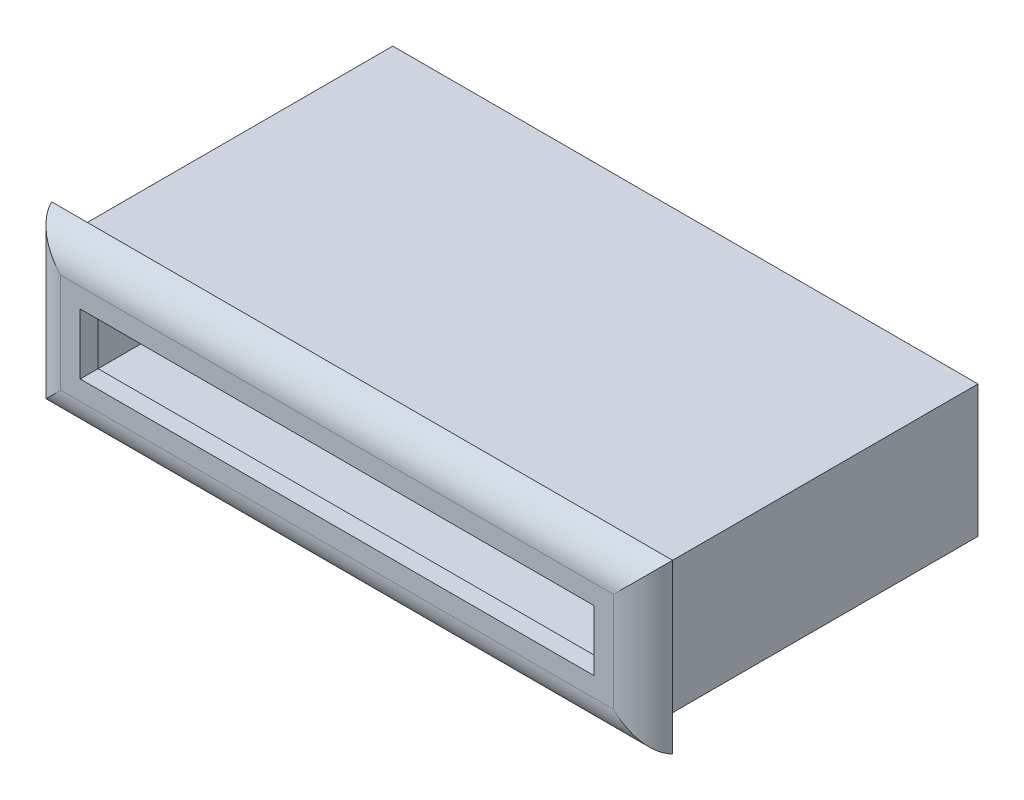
ISO-10303-21;
HEADER;
FILE_DESCRIPTION(('STEP AP214'),'2;1');
FILE_NAME('part.step','',(''),(''),'','','');
FILE_SCHEMA(('AUTOMOTIVE_DESIGN { 1 0 10303 214 1 1 1 1 }'));
ENDSEC;
DATA;
#1=APPLICATION_CONTEXT('core data for automotive mechanical design processes');
#2=APPLICATION_PROTOCOL_DEFINITION('international standard','automotive_design',2000,#1);
#3=PRODUCT_CONTEXT('',#1,'mechanical');
#4=PRODUCT('Part','Part','',(#3));
#5=PRODUCT_RELATED_PRODUCT_CATEGORY('part','',(#4));
#6=PRODUCT_DEFINITION_FORMATION('','',#4);
#7=PRODUCT_DEFINITION_CONTEXT('part definition',#1,'design');
#8=PRODUCT_DEFINITION('design','',#6,#7);
#9=PRODUCT_DEFINITION_SHAPE('','',#8);
#10=(LENGTH_UNIT() NAMED_UNIT(*) SI_UNIT(.MILLI.,.METRE.));
#11=(NAMED_UNIT(*) PLANE_ANGLE_UNIT() SI_UNIT($,.RADIAN.));
#12=(NAMED_UNIT(*) SI_UNIT($,.STERADIAN.) SOLID_ANGLE_UNIT());
#13=UNCERTAINTY_MEASURE_WITH_UNIT(LENGTH_MEASURE(1.E-05),#10,'distance_accuracy_value','');
#14=(GEOMETRIC_REPRESENTATION_CONTEXT(3) GLOBAL_UNCERTAINTY_ASSIGNED_CONTEXT((#13)) GLOBAL_UNIT_ASSIGNED_CONTEXT((#10,
#11,#12)) REPRESENTATION_CONTEXT('',''));
#15=CARTESIAN_POINT('',(0.,0.,0.));
#16=DIRECTION('',(0.,0.,1.));
#17=DIRECTION('',(1.,0.,0.));
#18=AXIS2_PLACEMENT_3D('',#15,#16,#17);
#19=CARTESIAN_POINT('',(-58.2280613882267,34.4863530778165,-3.5));
#20=DIRECTION('',(-1.,0.,0.));
#21=DIRECTION('',(0.,-1.,0.));
#22=AXIS2_PLACEMENT_3D('',#19,#20,#21);
#23=PLANE('',#22);
#24=DIRECTION('',(0.,1.,0.));
#25=VECTOR('',#24,1.);
#26=CARTESIAN_POINT('',(-58.2280613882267,34.4863530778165,-48.8));
#27=LINE('',#26,#25);
#28=CARTESIAN_POINT('',(-58.2280613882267,31.9863530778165,-48.8));
#29=VERTEX_POINT('',#28);
#30=CARTESIAN_POINT('',(-58.2280613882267,34.4863530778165,-48.8));
#31=VERTEX_POINT('',#30);
#32=EDGE_CURVE('E189',#29,#31,#27,.T.);
#33=ORIENTED_EDGE('',*,*,#32,.F.);
#34=DIRECTION('',(0.,0.,1.));
#35=VECTOR('',#34,1.);
#36=CARTESIAN_POINT('',(-58.2280613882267,31.9863530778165,0.));
#37=LINE('',#36,#35);
#38=CARTESIAN_POINT('',(-58.2280613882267,31.9863530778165,-43.0569075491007));
#39=VERTEX_POINT('',#38);
#40=EDGE_CURVE('E200',#29,#39,#37,.T.);
#41=ORIENTED_EDGE('',*,*,#40,.T.);
#42=DIRECTION('',(0.,1.,0.));
#43=VECTOR('',#42,1.);
#44=CARTESIAN_POINT('',(-58.2280613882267,0.,-43.0569075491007));
#45=LINE('',#44,#43);
#46=CARTESIAN_POINT('',(-58.2280613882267,29.2363530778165,-43.0569075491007));
#47=VERTEX_POINT('',#46);
#48=EDGE_CURVE('E368',#47,#39,#45,.T.);
#49=ORIENTED_EDGE('',*,*,#48,.F.);
#50=DIRECTION('',(0.,0.,1.));
#51=VECTOR('',#50,1.);
#52=CARTESIAN_POINT('',(-58.2280613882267,29.2363530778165,0.));
#53=LINE('',#52,#51);
#54=CARTESIAN_POINT('',(-58.2280613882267,29.2363530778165,-23.8));
#55=VERTEX_POINT('',#54);
#56=EDGE_CURVE('E378',#47,#55,#53,.T.);
#57=ORIENTED_EDGE('',*,*,#56,.T.);
#58=DIRECTION('',(0.,1.,0.));
#59=VECTOR('',#58,1.);
#60=CARTESIAN_POINT('',(-58.2280613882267,0.,-23.8));
#61=LINE('',#60,#59);
#62=CARTESIAN_POINT('',(-58.2280613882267,21.2363530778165,-23.8));
#63=VERTEX_POINT('',#62);
#64=EDGE_CURVE('E381',#63,#55,#61,.T.);
#65=ORIENTED_EDGE('',*,*,#64,.F.);
#66=DIRECTION('',(0.,0.,-1.));
#67=VECTOR('',#66,1.);
#68=CARTESIAN_POINT('',(-58.2280613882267,21.2363530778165,0.));
#69=LINE('',#68,#67);
#70=CARTESIAN_POINT('',(-58.2280613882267,21.2363530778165,-43.0569075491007));
#71=VERTEX_POINT('',#70);
#72=EDGE_CURVE('E384',#63,#71,#69,.T.);
#73=ORIENTED_EDGE('',*,*,#72,.T.);
#74=DIRECTION('',(0.,-1.,0.));
#75=VECTOR('',#74,1.);
#76=CARTESIAN_POINT('',(-58.2280613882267,0.,-43.0569075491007));
#77=LINE('',#76,#75);
#78=CARTESIAN_POINT('',(-58.2280613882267,18.4863530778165,-43.0569075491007));
#79=VERTEX_POINT('',#78);
#80=EDGE_CURVE('E387',#71,#79,#77,.T.);
#81=ORIENTED_EDGE('',*,*,#80,.T.);
#82=DIRECTION('',(0.,0.,-1.));
#83=VECTOR('',#82,1.);
#84=CARTESIAN_POINT('',(-58.2280613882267,18.4863530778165,0.));
#85=LINE('',#84,#83);
#86=CARTESIAN_POINT('',(-58.2280613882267,18.4863530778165,-48.8));
#87=VERTEX_POINT('',#86);
#88=EDGE_CURVE('E207',#79,#87,#85,.T.);
#89=ORIENTED_EDGE('',*,*,#88,.T.);
#90=CARTESIAN_POINT('',(-58.2280613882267,15.9863530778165,-48.8));
#91=VERTEX_POINT('',#90);
#92=EDGE_CURVE('E212',#91,#87,#27,.T.);
#93=ORIENTED_EDGE('',*,*,#92,.F.);
#94=DIRECTION('',(0.,0.,-1.));
#95=VECTOR('',#94,1.);
#96=CARTESIAN_POINT('',(-58.2280613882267,15.9863530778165,-3.5));
#97=LINE('',#96,#95);
#98=CARTESIAN_POINT('',(-58.2280613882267,15.9863530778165,-3.5));
#99=VERTEX_POINT('',#98);
#100=EDGE_CURVE('E227',#99,#91,#97,.T.);
#101=ORIENTED_EDGE('',*,*,#100,.F.);
#102=DIRECTION('',(0.,1.,0.));
#103=VECTOR('',#102,1.);
#104=CARTESIAN_POINT('',(-58.2280613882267,34.4863530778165,-3.5));
#105=LINE('',#104,#103);
#106=CARTESIAN_POINT('',(-58.2280613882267,34.4863530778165,-3.5));
#107=VERTEX_POINT('',#106);
#108=EDGE_CURVE('E321',#99,#107,#105,.T.);
#109=ORIENTED_EDGE('',*,*,#108,.T.);
#110=DIRECTION('',(0.,0.,-1.));
#111=VECTOR('',#110,1.);
#112=CARTESIAN_POINT('',(-58.2280613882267,34.4863530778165,-3.5));
#113=LINE('',#112,#111);
#114=EDGE_CURVE('E210',#107,#31,#113,.T.);
#115=ORIENTED_EDGE('',*,*,#114,.T.);
#116=EDGE_LOOP('',(#33,#41,#49,#57,#65,#73,#81,#89,#93,#101,#109,#115));
#117=FACE_BOUND('',#116,.T.);
#118=ADVANCED_FACE('F33',(#117),#23,.T.);
#119=CARTESIAN_POINT('',(0.,0.,-48.8));
#120=DIRECTION('',(0.,0.,1.));
#121=DIRECTION('',(1.,0.,0.));
#122=AXIS2_PLACEMENT_3D('',#119,#120,#121);
#123=PLANE('',#122);
#124=DIRECTION('',(1.,0.,0.));
#125=VECTOR('',#124,1.);
#126=CARTESIAN_POINT('',(21.2719386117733,31.9863530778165,-48.8));
#127=LINE('',#126,#125);
#128=CARTESIAN_POINT('',(21.2719386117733,31.9863530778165,-48.8));
#129=VERTEX_POINT('',#128);
#130=EDGE_CURVE('E184',#29,#129,#127,.T.);
#131=ORIENTED_EDGE('',*,*,#130,.F.);
#132=ORIENTED_EDGE('',*,*,#32,.T.);
#133=DIRECTION('',(1.,0.,0.));
#134=VECTOR('',#133,1.);
#135=CARTESIAN_POINT('',(23.7719386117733,34.4863530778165,-48.8));
#136=LINE('',#135,#134);
#137=CARTESIAN_POINT('',(23.7719386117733,34.4863530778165,-48.8));
#138=VERTEX_POINT('',#137);
#139=EDGE_CURVE('E216',#31,#138,#136,.T.);
#140=ORIENTED_EDGE('',*,*,#139,.T.);
#141=DIRECTION('',(0.,-1.,0.));
#142=VECTOR('',#141,1.);
#143=CARTESIAN_POINT('',(23.7719386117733,34.4863530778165,-48.8));
#144=LINE('',#143,#142);
#145=CARTESIAN_POINT('',(23.7719386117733,15.9863530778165,-48.8));
#146=VERTEX_POINT('',#145);
#147=EDGE_CURVE('E196',#138,#146,#144,.T.);
#148=ORIENTED_EDGE('',*,*,#147,.T.);
#149=DIRECTION('',(-1.,0.,0.));
#150=VECTOR('',#149,1.);
#151=CARTESIAN_POINT('',(23.7719386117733,15.9863530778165,-48.8));
#152=LINE('',#151,#150);
#153=EDGE_CURVE('E213',#146,#91,#152,.T.);
#154=ORIENTED_EDGE('',*,*,#153,.T.);
#155=ORIENTED_EDGE('',*,*,#92,.T.);
#156=DIRECTION('',(-1.,0.,0.));
#157=VECTOR('',#156,1.);
#158=CARTESIAN_POINT('',(21.2719386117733,18.4863530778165,-48.8));
#159=LINE('',#158,#157);
#160=CARTESIAN_POINT('',(21.2719386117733,18.4863530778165,-48.8));
#161=VERTEX_POINT('',#160);
#162=EDGE_CURVE('E197',#161,#87,#159,.T.);
#163=ORIENTED_EDGE('',*,*,#162,.F.);
#164=DIRECTION('',(0.,-1.,0.));
#165=VECTOR('',#164,1.);
#166=CARTESIAN_POINT('',(21.2719386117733,31.9863530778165,-48.8));
#167=LINE('',#166,#165);
#168=EDGE_CURVE('E193',#129,#161,#167,.T.);
#169=ORIENTED_EDGE('',*,*,#168,.F.);
#170=EDGE_LOOP('',(#131,#132,#140,#148,#154,#155,#163,#169));
#171=FACE_BOUND('',#170,.T.);
#172=ADVANCED_FACE('F186',(#171),#123,.F.);
#173=CARTESIAN_POINT('',(0.,0.,0.));
#174=DIRECTION('',(0.,0.,1.));
#175=DIRECTION('',(1.,0.,0.));
#176=AXIS2_PLACEMENT_3D('',#173,#174,#175);
#177=PLANE('',#176);
#178=DIRECTION('',(-1.,0.,0.));
#179=VECTOR('',#178,1.);
#180=CARTESIAN_POINT('',(26.2719386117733,18.2560490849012,0.));
#181=LINE('',#180,#179);
#182=CARTESIAN_POINT('',(-55.958365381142,18.2560490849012,0.));
#183=VERTEX_POINT('',#182);
#184=CARTESIAN_POINT('',(21.5022426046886,18.2560490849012,0.));
#185=VERTEX_POINT('',#184);
#186=EDGE_CURVE('E42',#183,#185,#181,.F.);
#187=ORIENTED_EDGE('',*,*,#186,.T.);
#188=DIRECTION('',(0.,-1.,0.));
#189=VECTOR('',#188,1.);
#190=CARTESIAN_POINT('',(21.5022426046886,36.9863530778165,0.));
#191=LINE('',#190,#189);
#192=CARTESIAN_POINT('',(21.5022426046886,32.2166570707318,0.));
#193=VERTEX_POINT('',#192);
#194=EDGE_CURVE('E11',#185,#193,#191,.F.);
#195=ORIENTED_EDGE('',*,*,#194,.T.);
#196=DIRECTION('',(1.,0.,0.));
#197=VECTOR('',#196,1.);
#198=CARTESIAN_POINT('',(-60.7280613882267,32.2166570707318,0.));
#199=LINE('',#198,#197);
#200=CARTESIAN_POINT('',(-55.958365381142,32.2166570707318,0.));
#201=VERTEX_POINT('',#200);
#202=EDGE_CURVE('E295',#193,#201,#199,.F.);
#203=ORIENTED_EDGE('',*,*,#202,.T.);
#204=DIRECTION('',(0.,1.,0.));
#205=VECTOR('',#204,1.);
#206=CARTESIAN_POINT('',(-55.958365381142,13.4863530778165,0.));
#207=LINE('',#206,#205);
#208=EDGE_CURVE('E288',#201,#183,#207,.F.);
#209=ORIENTED_EDGE('',*,*,#208,.T.);
#210=EDGE_LOOP('',(#187,#195,#203,#209));
#211=FACE_BOUND('',#210,.T.);
#212=DIRECTION('',(0.,-1.,0.));
#213=VECTOR('',#212,1.);
#214=CARTESIAN_POINT('',(-53.2280613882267,29.4863530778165,0.));
#215=LINE('',#214,#213);
#216=CARTESIAN_POINT('',(-53.2280613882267,29.4863530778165,0.));
#217=VERTEX_POINT('',#216);
#218=CARTESIAN_POINT('',(-53.2280613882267,20.9863530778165,0.));
#219=VERTEX_POINT('',#218);
#220=EDGE_CURVE('E241',#217,#219,#215,.T.);
#221=ORIENTED_EDGE('',*,*,#220,.F.);
#222=DIRECTION('',(-1.,0.,0.));
#223=VECTOR('',#222,1.);
#224=CARTESIAN_POINT('',(-53.2280613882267,29.4863530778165,0.));
#225=LINE('',#224,#223);
#226=CARTESIAN_POINT('',(18.7719386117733,29.4863530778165,0.));
#227=VERTEX_POINT('',#226);
#228=EDGE_CURVE('E246',#227,#217,#225,.T.);
#229=ORIENTED_EDGE('',*,*,#228,.F.);
#230=DIRECTION('',(0.,1.,0.));
#231=VECTOR('',#230,1.);
#232=CARTESIAN_POINT('',(18.7719386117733,29.4863530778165,0.));
#233=LINE('',#232,#231);
#234=CARTESIAN_POINT('',(18.7719386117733,20.9863530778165,0.));
#235=VERTEX_POINT('',#234);
#236=EDGE_CURVE('E260',#235,#227,#233,.T.);
#237=ORIENTED_EDGE('',*,*,#236,.F.);
#238=DIRECTION('',(1.,0.,0.));
#239=VECTOR('',#238,1.);
#240=CARTESIAN_POINT('',(-53.2280613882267,20.9863530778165,0.));
#241=LINE('',#240,#239);
#242=EDGE_CURVE('E257',#219,#235,#241,.T.);
#243=ORIENTED_EDGE('',*,*,#242,.F.);
#244=EDGE_LOOP('',(#221,#229,#237,#243));
#245=FACE_BOUND('',#244,.T.);
#246=ADVANCED_FACE('F420',(#211,#245),#177,.T.);
#247=CARTESIAN_POINT('',(0.,0.,-2.5));
#248=DIRECTION('',(0.,0.,1.));
#249=DIRECTION('',(1.,0.,0.));
#250=AXIS2_PLACEMENT_3D('',#247,#248,#249);
#251=PLANE('',#250);
#252=DIRECTION('',(-1.,0.,0.));
#253=VECTOR('',#252,1.);
#254=CARTESIAN_POINT('',(-53.2280613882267,29.4863530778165,-2.5));
#255=LINE('',#254,#253);
#256=CARTESIAN_POINT('',(18.7719386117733,29.4863530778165,-2.5));
#257=VERTEX_POINT('',#256);
#258=CARTESIAN_POINT('',(-53.2280613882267,29.4863530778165,-2.5));
#259=VERTEX_POINT('',#258);
#260=EDGE_CURVE('E252',#257,#259,#255,.T.);
#261=ORIENTED_EDGE('',*,*,#260,.T.);
#262=DIRECTION('',(0.,-1.,0.));
#263=VECTOR('',#262,1.);
#264=CARTESIAN_POINT('',(-53.2280613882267,29.4863530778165,-2.5));
#265=LINE('',#264,#263);
#266=CARTESIAN_POINT('',(-53.2280613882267,20.9863530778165,-2.5));
#267=VERTEX_POINT('',#266);
#268=EDGE_CURVE('E242',#259,#267,#265,.T.);
#269=ORIENTED_EDGE('',*,*,#268,.T.);
#270=DIRECTION('',(1.,0.,0.));
#271=VECTOR('',#270,1.);
#272=CARTESIAN_POINT('',(-53.2280613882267,20.9863530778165,-2.5));
#273=LINE('',#272,#271);
#274=CARTESIAN_POINT('',(18.7719386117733,20.9863530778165,-2.5));
#275=VERTEX_POINT('',#274);
#276=EDGE_CURVE('E245',#267,#275,#273,.T.);
#277=ORIENTED_EDGE('',*,*,#276,.T.);
#278=DIRECTION('',(0.,1.,0.));
#279=VECTOR('',#278,1.);
#280=CARTESIAN_POINT('',(18.7719386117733,29.4863530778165,-2.5));
#281=LINE('',#280,#279);
#282=EDGE_CURVE('E249',#275,#257,#281,.T.);
#283=ORIENTED_EDGE('',*,*,#282,.T.);
#284=EDGE_LOOP('',(#261,#269,#277,#283));
#285=FACE_BOUND('',#284,.T.);
#286=DIRECTION('',(0.,-1.,0.));
#287=VECTOR('',#286,1.);
#288=CARTESIAN_POINT('',(-55.7280613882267,31.9863530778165,-2.5));
#289=LINE('',#288,#287);
#290=CARTESIAN_POINT('',(-55.7280613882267,31.9863530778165,-2.5));
#291=VERTEX_POINT('',#290);
#292=CARTESIAN_POINT('',(-55.7280613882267,18.4863530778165,-2.5));
#293=VERTEX_POINT('',#292);
#294=EDGE_CURVE('E267',#291,#293,#289,.T.);
#295=ORIENTED_EDGE('',*,*,#294,.F.);
#296=DIRECTION('',(-1.,0.,0.));
#297=VECTOR('',#296,1.);
#298=CARTESIAN_POINT('',(-55.7280613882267,31.9863530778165,-2.5));
#299=LINE('',#298,#297);
#300=CARTESIAN_POINT('',(21.2719386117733,31.9863530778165,-2.5));
#301=VERTEX_POINT('',#300);
#302=EDGE_CURVE('E282',#301,#291,#299,.T.);
#303=ORIENTED_EDGE('',*,*,#302,.F.);
#304=DIRECTION('',(0.,1.,0.));
#305=VECTOR('',#304,1.);
#306=CARTESIAN_POINT('',(21.2719386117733,31.9863530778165,-2.5));
#307=LINE('',#306,#305);
#308=CARTESIAN_POINT('',(21.2719386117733,18.4863530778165,-2.5));
#309=VERTEX_POINT('',#308);
#310=EDGE_CURVE('E279',#309,#301,#307,.T.);
#311=ORIENTED_EDGE('',*,*,#310,.F.);
#312=DIRECTION('',(1.,0.,0.));
#313=VECTOR('',#312,1.);
#314=CARTESIAN_POINT('',(-55.7280613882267,18.4863530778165,-2.5));
#315=LINE('',#314,#313);
#316=EDGE_CURVE('E276',#293,#309,#315,.T.);
#317=ORIENTED_EDGE('',*,*,#316,.F.);
#318=EDGE_LOOP('',(#295,#303,#311,#317));
#319=FACE_BOUND('',#318,.T.);
#320=ADVANCED_FACE('F346',(#285,#319),#251,.F.);
#321=CARTESIAN_POINT('',(-53.2280613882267,29.4863530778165,-2.5));
#322=DIRECTION('',(-1.,0.,0.));
#323=DIRECTION('',(0.,-1.,0.));
#324=AXIS2_PLACEMENT_3D('',#321,#322,#323);
#325=PLANE('',#324);
#326=ORIENTED_EDGE('',*,*,#220,.T.);
#327=DIRECTION('',(0.,0.,1.));
#328=VECTOR('',#327,1.);
#329=CARTESIAN_POINT('',(-53.2280613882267,20.9863530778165,-2.5));
#330=LINE('',#329,#328);
#331=EDGE_CURVE('E255',#267,#219,#330,.T.);
#332=ORIENTED_EDGE('',*,*,#331,.F.);
#333=ORIENTED_EDGE('',*,*,#268,.F.);
#334=DIRECTION('',(0.,0.,1.));
#335=VECTOR('',#334,1.);
#336=CARTESIAN_POINT('',(-53.2280613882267,29.4863530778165,-2.5));
#337=LINE('',#336,#335);
#338=EDGE_CURVE('E265',#259,#217,#337,.T.);
#339=ORIENTED_EDGE('',*,*,#338,.T.);
#340=EDGE_LOOP('',(#326,#332,#333,#339));
#341=FACE_BOUND('',#340,.T.);
#342=ADVANCED_FACE('F438',(#341),#325,.F.);
#343=CARTESIAN_POINT('',(-53.2280613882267,29.4863530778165,-2.5));
#344=DIRECTION('',(0.,1.,0.));
#345=DIRECTION('',(0.,0.,1.));
#346=AXIS2_PLACEMENT_3D('',#343,#344,#345);
#347=PLANE('',#346);
#348=ORIENTED_EDGE('',*,*,#228,.T.);
#349=ORIENTED_EDGE('',*,*,#338,.F.);
#350=ORIENTED_EDGE('',*,*,#260,.F.);
#351=DIRECTION('',(0.,0.,1.));
#352=VECTOR('',#351,1.);
#353=CARTESIAN_POINT('',(18.7719386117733,29.4863530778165,-2.5));
#354=LINE('',#353,#352);
#355=EDGE_CURVE('E268',#257,#227,#354,.T.);
#356=ORIENTED_EDGE('',*,*,#355,.T.);
#357=EDGE_LOOP('',(#348,#349,#350,#356));
#358=FACE_BOUND('',#357,.T.);
#359=ADVANCED_FACE('F434',(#358),#347,.F.);
#360=CARTESIAN_POINT('',(18.7719386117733,29.4863530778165,-2.5));
#361=DIRECTION('',(1.,0.,0.));
#362=DIRECTION('',(0.,1.,0.));
#363=AXIS2_PLACEMENT_3D('',#360,#361,#362);
#364=PLANE('',#363);
#365=ORIENTED_EDGE('',*,*,#236,.T.);
#366=ORIENTED_EDGE('',*,*,#355,.F.);
#367=ORIENTED_EDGE('',*,*,#282,.F.);
#368=DIRECTION('',(0.,0.,1.));
#369=VECTOR('',#368,1.);
#370=CARTESIAN_POINT('',(18.7719386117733,20.9863530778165,-2.5));
#371=LINE('',#370,#369);
#372=EDGE_CURVE('E270',#275,#235,#371,.T.);
#373=ORIENTED_EDGE('',*,*,#372,.T.);
#374=EDGE_LOOP('',(#365,#366,#367,#373));
#375=FACE_BOUND('',#374,.T.);
#376=ADVANCED_FACE('F437',(#375),#364,.F.);
#377=CARTESIAN_POINT('',(-53.2280613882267,20.9863530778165,-2.5));
#378=DIRECTION('',(0.,-1.,0.));
#379=DIRECTION('',(0.,0.,-1.));
#380=AXIS2_PLACEMENT_3D('',#377,#378,#379);
#381=PLANE('',#380);
#382=ORIENTED_EDGE('',*,*,#242,.T.);
#383=ORIENTED_EDGE('',*,*,#372,.F.);
#384=ORIENTED_EDGE('',*,*,#276,.F.);
#385=ORIENTED_EDGE('',*,*,#331,.T.);
#386=EDGE_LOOP('',(#382,#383,#384,#385));
#387=FACE_BOUND('',#386,.T.);
#388=ADVANCED_FACE('F442',(#387),#381,.F.);
#389=CARTESIAN_POINT('',(-55.7280613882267,18.4863530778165,-43.8));
#390=DIRECTION('',(0.,-1.,0.));
#391=DIRECTION('',(0.,0.,-1.));
#392=AXIS2_PLACEMENT_3D('',#389,#390,#391);
#393=PLANE('',#392);
#394=ORIENTED_EDGE('',*,*,#162,.T.);
#395=ORIENTED_EDGE('',*,*,#88,.F.);
#396=DIRECTION('',(-1.,0.,0.));
#397=VECTOR('',#396,1.);
#398=CARTESIAN_POINT('',(-48.2280613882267,18.4863530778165,-43.0569075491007));
#399=LINE('',#398,#397);
#400=CARTESIAN_POINT('',(-55.7280613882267,18.4863530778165,-43.0569075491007));
#401=VERTEX_POINT('',#400);
#402=EDGE_CURVE('E365',#401,#79,#399,.T.);
#403=ORIENTED_EDGE('',*,*,#402,.F.);
#404=DIRECTION('',(0.,0.,1.));
#405=VECTOR('',#404,1.);
#406=CARTESIAN_POINT('',(-55.7280613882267,18.4863530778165,-43.8));
#407=LINE('',#406,#405);
#408=EDGE_CURVE('E285',#401,#293,#407,.T.);
#409=ORIENTED_EDGE('',*,*,#408,.T.);
#410=ORIENTED_EDGE('',*,*,#316,.T.);
#411=DIRECTION('',(0.,0.,1.));
#412=VECTOR('',#411,1.);
#413=CARTESIAN_POINT('',(21.2719386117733,18.4863530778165,-43.8));
#414=LINE('',#413,#412);
#415=EDGE_CURVE('E291',#161,#309,#414,.T.);
#416=ORIENTED_EDGE('',*,*,#415,.F.);
#417=EDGE_LOOP('',(#394,#395,#403,#409,#410,#416));
#418=FACE_BOUND('',#417,.T.);
#419=ADVANCED_FACE('F338',(#418),#393,.F.);
#420=CARTESIAN_POINT('',(21.2719386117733,31.9863530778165,-43.8));
#421=DIRECTION('',(1.,0.,0.));
#422=DIRECTION('',(0.,0.,-1.));
#423=AXIS2_PLACEMENT_3D('',#420,#421,#422);
#424=PLANE('',#423);
#425=ORIENTED_EDGE('',*,*,#415,.T.);
#426=ORIENTED_EDGE('',*,*,#310,.T.);
#427=DIRECTION('',(0.,0.,1.));
#428=VECTOR('',#427,1.);
#429=CARTESIAN_POINT('',(21.2719386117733,31.9863530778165,-43.8));
#430=LINE('',#429,#428);
#431=EDGE_CURVE('E289',#129,#301,#430,.T.);
#432=ORIENTED_EDGE('',*,*,#431,.F.);
#433=ORIENTED_EDGE('',*,*,#168,.T.);
#434=EDGE_LOOP('',(#425,#426,#432,#433));
#435=FACE_BOUND('',#434,.T.);
#436=ADVANCED_FACE('F342',(#435),#424,.F.);
#437=CARTESIAN_POINT('',(-55.7280613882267,31.9863530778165,-43.8));
#438=DIRECTION('',(0.,1.,0.));
#439=DIRECTION('',(0.,0.,1.));
#440=AXIS2_PLACEMENT_3D('',#437,#438,#439);
#441=PLANE('',#440);
#442=DIRECTION('',(0.,0.,1.));
#443=VECTOR('',#442,1.);
#444=CARTESIAN_POINT('',(-55.7280613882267,31.9863530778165,-43.8));
#445=LINE('',#444,#443);
#446=CARTESIAN_POINT('',(-55.7280613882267,31.9863530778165,-43.0569075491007));
#447=VERTEX_POINT('',#446);
#448=EDGE_CURVE('E286',#447,#291,#445,.T.);
#449=ORIENTED_EDGE('',*,*,#448,.F.);
#450=DIRECTION('',(-1.,0.,0.));
#451=VECTOR('',#450,1.);
#452=CARTESIAN_POINT('',(-48.2280613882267,31.9863530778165,-43.0569075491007));
#453=LINE('',#452,#451);
#454=EDGE_CURVE('E203',#447,#39,#453,.T.);
#455=ORIENTED_EDGE('',*,*,#454,.T.);
#456=ORIENTED_EDGE('',*,*,#40,.F.);
#457=ORIENTED_EDGE('',*,*,#130,.T.);
#458=ORIENTED_EDGE('',*,*,#431,.T.);
#459=ORIENTED_EDGE('',*,*,#302,.T.);
#460=EDGE_LOOP('',(#449,#455,#456,#457,#458,#459));
#461=FACE_BOUND('',#460,.T.);
#462=ADVANCED_FACE('F202',(#461),#441,.F.);
#463=CARTESIAN_POINT('',(-55.7280613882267,31.9863530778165,-43.8));
#464=DIRECTION('',(-1.,0.,0.));
#465=DIRECTION('',(0.,0.,1.));
#466=AXIS2_PLACEMENT_3D('',#463,#464,#465);
#467=PLANE('',#466);
#468=DIRECTION('',(0.,0.,1.));
#469=VECTOR('',#468,1.);
#470=CARTESIAN_POINT('',(-55.7280613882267,29.2363530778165,-43.8));
#471=LINE('',#470,#469);
#472=CARTESIAN_POINT('',(-55.7280613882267,29.2363530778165,-43.0569075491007));
#473=VERTEX_POINT('',#472);
#474=CARTESIAN_POINT('',(-55.7280613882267,29.2363530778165,-23.8));
#475=VERTEX_POINT('',#474);
#476=EDGE_CURVE('E353',#473,#475,#471,.T.);
#477=ORIENTED_EDGE('',*,*,#476,.F.);
#478=DIRECTION('',(0.,1.,0.));
#479=VECTOR('',#478,1.);
#480=CARTESIAN_POINT('',(-55.7280613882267,31.9863530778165,-43.0569075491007));
#481=LINE('',#480,#479);
#482=EDGE_CURVE('E300',#473,#447,#481,.T.);
#483=ORIENTED_EDGE('',*,*,#482,.T.);
#484=ORIENTED_EDGE('',*,*,#448,.T.);
#485=ORIENTED_EDGE('',*,*,#294,.T.);
#486=ORIENTED_EDGE('',*,*,#408,.F.);
#487=DIRECTION('',(0.,-1.,0.));
#488=VECTOR('',#487,1.);
#489=CARTESIAN_POINT('',(-55.7280613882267,31.9863530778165,-43.0569075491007));
#490=LINE('',#489,#488);
#491=CARTESIAN_POINT('',(-55.7280613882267,21.2363530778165,-43.0569075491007));
#492=VERTEX_POINT('',#491);
#493=EDGE_CURVE('E363',#492,#401,#490,.T.);
#494=ORIENTED_EDGE('',*,*,#493,.F.);
#495=DIRECTION('',(0.,0.,-1.));
#496=VECTOR('',#495,1.);
#497=CARTESIAN_POINT('',(-55.7280613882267,21.2363530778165,-43.8));
#498=LINE('',#497,#496);
#499=CARTESIAN_POINT('',(-55.7280613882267,21.2363530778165,-23.8));
#500=VERTEX_POINT('',#499);
#501=EDGE_CURVE('E359',#500,#492,#498,.T.);
#502=ORIENTED_EDGE('',*,*,#501,.F.);
#503=DIRECTION('',(0.,1.,0.));
#504=VECTOR('',#503,1.);
#505=CARTESIAN_POINT('',(-55.7280613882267,31.9863530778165,-23.8));
#506=LINE('',#505,#504);
#507=EDGE_CURVE('E356',#500,#475,#506,.T.);
#508=ORIENTED_EDGE('',*,*,#507,.T.);
#509=EDGE_LOOP('',(#477,#483,#484,#485,#486,#494,#502,#508));
#510=FACE_BOUND('',#509,.T.);
#511=ADVANCED_FACE('F350',(#510),#467,.F.);
#512=CARTESIAN_POINT('',(0.,0.,-3.5));
#513=DIRECTION('',(0.,0.,-1.));
#514=DIRECTION('',(-1.,0.,0.));
#515=AXIS2_PLACEMENT_3D('',#512,#513,#514);
#516=PLANE('',#515);
#517=DIRECTION('',(1.,0.,0.));
#518=VECTOR('',#517,1.);
#519=CARTESIAN_POINT('',(23.7719386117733,34.4863530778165,-3.5));
#520=LINE('',#519,#518);
#521=CARTESIAN_POINT('',(23.7719386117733,34.4863530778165,-3.5));
#522=VERTEX_POINT('',#521);
#523=EDGE_CURVE('E232',#107,#522,#520,.T.);
#524=ORIENTED_EDGE('',*,*,#523,.F.);
#525=ORIENTED_EDGE('',*,*,#108,.F.);
#526=DIRECTION('',(-1.,0.,0.));
#527=VECTOR('',#526,1.);
#528=CARTESIAN_POINT('',(23.7719386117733,15.9863530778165,-3.5));
#529=LINE('',#528,#527);
#530=CARTESIAN_POINT('',(23.7719386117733,15.9863530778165,-3.5));
#531=VERTEX_POINT('',#530);
#532=EDGE_CURVE('E318',#531,#99,#529,.T.);
#533=ORIENTED_EDGE('',*,*,#532,.F.);
#534=DIRECTION('',(0.,-1.,0.));
#535=VECTOR('',#534,1.);
#536=CARTESIAN_POINT('',(23.7719386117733,34.4863530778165,-3.5));
#537=LINE('',#536,#535);
#538=EDGE_CURVE('E222',#522,#531,#537,.T.);
#539=ORIENTED_EDGE('',*,*,#538,.F.);
#540=EDGE_LOOP('',(#524,#525,#533,#539));
#541=FACE_BOUND('',#540,.T.);
#542=DIRECTION('',(0.,-1.,0.));
#543=VECTOR('',#542,1.);
#544=CARTESIAN_POINT('',(26.2719386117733,36.9863530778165,-3.5));
#545=LINE('',#544,#543);
#546=CARTESIAN_POINT('',(26.2719386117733,36.9863530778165,-3.5));
#547=VERTEX_POINT('',#546);
#548=CARTESIAN_POINT('',(26.2719386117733,13.4863530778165,-3.5));
#549=VERTEX_POINT('',#548);
#550=EDGE_CURVE('E225',#547,#549,#545,.T.);
#551=ORIENTED_EDGE('',*,*,#550,.T.);
#552=DIRECTION('',(-1.,0.,0.));
#553=VECTOR('',#552,1.);
#554=CARTESIAN_POINT('',(26.2719386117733,13.4863530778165,-3.5));
#555=LINE('',#554,#553);
#556=CARTESIAN_POINT('',(-60.7280613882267,13.4863530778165,-3.5));
#557=VERTEX_POINT('',#556);
#558=EDGE_CURVE('E235',#549,#557,#555,.T.);
#559=ORIENTED_EDGE('',*,*,#558,.T.);
#560=DIRECTION('',(0.,1.,0.));
#561=VECTOR('',#560,1.);
#562=CARTESIAN_POINT('',(-60.7280613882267,36.9863530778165,-3.5));
#563=LINE('',#562,#561);
#564=CARTESIAN_POINT('',(-60.7280613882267,36.9863530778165,-3.5));
#565=VERTEX_POINT('',#564);
#566=EDGE_CURVE('E237',#557,#565,#563,.T.);
#567=ORIENTED_EDGE('',*,*,#566,.T.);
#568=DIRECTION('',(1.,0.,0.));
#569=VECTOR('',#568,1.);
#570=CARTESIAN_POINT('',(26.2719386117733,36.9863530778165,-3.5));
#571=LINE('',#570,#569);
#572=EDGE_CURVE('E239',#565,#547,#571,.T.);
#573=ORIENTED_EDGE('',*,*,#572,.T.);
#574=EDGE_LOOP('',(#551,#559,#567,#573));
#575=FACE_BOUND('',#574,.T.);
#576=ADVANCED_FACE('F430',(#541,#575),#516,.T.);
#577=CARTESIAN_POINT('',(23.7719386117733,34.4863530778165,-3.5));
#578=DIRECTION('',(1.,0.,0.));
#579=DIRECTION('',(0.,1.,0.));
#580=AXIS2_PLACEMENT_3D('',#577,#578,#579);
#581=PLANE('',#580);
#582=ORIENTED_EDGE('',*,*,#147,.F.);
#583=DIRECTION('',(0.,0.,-1.));
#584=VECTOR('',#583,1.);
#585=CARTESIAN_POINT('',(23.7719386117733,34.4863530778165,-3.5));
#586=LINE('',#585,#584);
#587=EDGE_CURVE('E223',#522,#138,#586,.T.);
#588=ORIENTED_EDGE('',*,*,#587,.F.);
#589=ORIENTED_EDGE('',*,*,#538,.T.);
#590=DIRECTION('',(0.,0.,-1.));
#591=VECTOR('',#590,1.);
#592=CARTESIAN_POINT('',(23.7719386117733,15.9863530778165,-3.5));
#593=LINE('',#592,#591);
#594=EDGE_CURVE('E230',#531,#146,#593,.T.);
#595=ORIENTED_EDGE('',*,*,#594,.T.);
#596=EDGE_LOOP('',(#582,#588,#589,#595));
#597=FACE_BOUND('',#596,.T.);
#598=ADVANCED_FACE('F328',(#597),#581,.T.);
#599=CARTESIAN_POINT('',(23.7719386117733,34.4863530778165,-3.5));
#600=DIRECTION('',(0.,1.,0.));
#601=DIRECTION('',(0.,0.,1.));
#602=AXIS2_PLACEMENT_3D('',#599,#600,#601);
#603=PLANE('',#602);
#604=ORIENTED_EDGE('',*,*,#139,.F.);
#605=ORIENTED_EDGE('',*,*,#114,.F.);
#606=ORIENTED_EDGE('',*,*,#523,.T.);
#607=ORIENTED_EDGE('',*,*,#587,.T.);
#608=EDGE_LOOP('',(#604,#605,#606,#607));
#609=FACE_BOUND('',#608,.T.);
#610=ADVANCED_FACE('F424',(#609),#603,.T.);
#611=CARTESIAN_POINT('',(23.7719386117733,15.9863530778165,-3.5));
#612=DIRECTION('',(0.,-1.,0.));
#613=DIRECTION('',(0.,0.,-1.));
#614=AXIS2_PLACEMENT_3D('',#611,#612,#613);
#615=PLANE('',#614);
#616=ORIENTED_EDGE('',*,*,#153,.F.);
#617=ORIENTED_EDGE('',*,*,#594,.F.);
#618=ORIENTED_EDGE('',*,*,#532,.T.);
#619=ORIENTED_EDGE('',*,*,#100,.T.);
#620=EDGE_LOOP('',(#616,#617,#618,#619));
#621=FACE_BOUND('',#620,.T.);
#622=ADVANCED_FACE('F332',(#621),#615,.T.);
#623=CARTESIAN_POINT('',(-55.958365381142,36.9863530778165,-5.));
#624=DIRECTION('',(0.,-1.,0.));
#625=DIRECTION('',(0.,0.,-1.));
#626=AXIS2_PLACEMENT_3D('',#623,#624,#625);
#627=CYLINDRICAL_SURFACE('',#626,5.);
#628=CARTESIAN_POINT('',(-55.958365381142,32.2166570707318,-5.));
#629=DIRECTION('',(-0.707106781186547,-0.707106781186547,0.));
#630=DIRECTION('',(0.707106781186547,-0.707106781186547,0.));
#631=AXIS2_PLACEMENT_3D('',#628,#629,#630);
#632=ELLIPSE('',#631,7.07106781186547,5.);
#633=EDGE_CURVE('E301',#565,#201,#632,.F.);
#634=ORIENTED_EDGE('',*,*,#633,.F.);
#635=ORIENTED_EDGE('',*,*,#566,.F.);
#636=CARTESIAN_POINT('',(-55.958365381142,18.2560490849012,-5.));
#637=DIRECTION('',(0.707106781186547,-0.707106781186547,0.));
#638=DIRECTION('',(-0.707106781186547,-0.707106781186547,0.));
#639=AXIS2_PLACEMENT_3D('',#636,#637,#638);
#640=ELLIPSE('',#639,7.07106781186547,5.);
#641=EDGE_CURVE('E37',#183,#557,#640,.T.);
#642=ORIENTED_EDGE('',*,*,#641,.F.);
#643=ORIENTED_EDGE('',*,*,#208,.F.);
#644=EDGE_LOOP('',(#634,#635,#642,#643));
#645=FACE_BOUND('',#644,.T.);
#646=ADVANCED_FACE('F35',(#645),#627,.T.);
#647=CARTESIAN_POINT('',(-60.7280613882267,18.2560490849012,-5.));
#648=DIRECTION('',(1.,0.,0.));
#649=DIRECTION('',(0.,0.,-1.));
#650=AXIS2_PLACEMENT_3D('',#647,#648,#649);
#651=CYLINDRICAL_SURFACE('',#650,5.);
#652=ORIENTED_EDGE('',*,*,#641,.T.);
#653=ORIENTED_EDGE('',*,*,#558,.F.);
#654=CARTESIAN_POINT('',(21.5022426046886,18.2560490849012,-5.));
#655=DIRECTION('',(0.707106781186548,0.707106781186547,0.));
#656=DIRECTION('',(0.707106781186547,-0.707106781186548,0.));
#657=AXIS2_PLACEMENT_3D('',#654,#655,#656);
#658=ELLIPSE('',#657,7.07106781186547,5.);
#659=EDGE_CURVE('E299',#185,#549,#658,.T.);
#660=ORIENTED_EDGE('',*,*,#659,.F.);
#661=ORIENTED_EDGE('',*,*,#186,.F.);
#662=EDGE_LOOP('',(#652,#653,#660,#661));
#663=FACE_BOUND('',#662,.T.);
#664=ADVANCED_FACE('F464',(#663),#651,.T.);
#665=CARTESIAN_POINT('',(-60.7280613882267,32.2166570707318,-5.));
#666=DIRECTION('',(-1.,0.,0.));
#667=DIRECTION('',(0.,0.,1.));
#668=AXIS2_PLACEMENT_3D('',#665,#666,#667);
#669=CYLINDRICAL_SURFACE('',#668,5.);
#670=ORIENTED_EDGE('',*,*,#633,.T.);
#671=ORIENTED_EDGE('',*,*,#202,.F.);
#672=CARTESIAN_POINT('',(21.5022426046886,32.2166570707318,-5.));
#673=DIRECTION('',(-0.707106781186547,0.707106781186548,0.));
#674=DIRECTION('',(-0.707106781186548,-0.707106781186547,0.));
#675=AXIS2_PLACEMENT_3D('',#672,#673,#674);
#676=ELLIPSE('',#675,7.07106781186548,5.);
#677=EDGE_CURVE('E56',#547,#193,#676,.F.);
#678=ORIENTED_EDGE('',*,*,#677,.F.);
#679=ORIENTED_EDGE('',*,*,#572,.F.);
#680=EDGE_LOOP('',(#670,#671,#678,#679));
#681=FACE_BOUND('',#680,.T.);
#682=ADVANCED_FACE('F413',(#681),#669,.T.);
#683=CARTESIAN_POINT('',(21.5022426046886,36.9863530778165,-5.));
#684=DIRECTION('',(0.,1.,0.));
#685=DIRECTION('',(-1.,0.,0.));
#686=AXIS2_PLACEMENT_3D('',#683,#684,#685);
#687=CYLINDRICAL_SURFACE('',#686,5.);
#688=ORIENTED_EDGE('',*,*,#659,.T.);
#689=ORIENTED_EDGE('',*,*,#550,.F.);
#690=ORIENTED_EDGE('',*,*,#677,.T.);
#691=ORIENTED_EDGE('',*,*,#194,.F.);
#692=EDGE_LOOP('',(#688,#689,#690,#691));
#693=FACE_BOUND('',#692,.T.);
#694=ADVANCED_FACE('F406',(#693),#687,.T.);
#695=CARTESIAN_POINT('',(-48.2280613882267,0.,-43.0569075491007));
#696=DIRECTION('',(0.,0.,1.));
#697=DIRECTION('',(1.,0.,0.));
#698=AXIS2_PLACEMENT_3D('',#695,#696,#697);
#699=PLANE('',#698);
#700=DIRECTION('',(-1.,0.,0.));
#701=VECTOR('',#700,1.);
#702=CARTESIAN_POINT('',(-48.2280613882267,29.2363530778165,-43.0569075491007));
#703=LINE('',#702,#701);
#704=EDGE_CURVE('E374',#473,#47,#703,.T.);
#705=ORIENTED_EDGE('',*,*,#704,.T.);
#706=ORIENTED_EDGE('',*,*,#48,.T.);
#707=ORIENTED_EDGE('',*,*,#454,.F.);
#708=ORIENTED_EDGE('',*,*,#482,.F.);
#709=EDGE_LOOP('',(#705,#706,#707,#708));
#710=FACE_BOUND('',#709,.T.);
#711=ADVANCED_FACE('F404',(#710),#699,.F.);
#712=CARTESIAN_POINT('',(-48.2280613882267,29.2363530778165,0.));
#713=DIRECTION('',(0.,-1.,0.));
#714=DIRECTION('',(1.,0.,0.));
#715=AXIS2_PLACEMENT_3D('',#712,#713,#714);
#716=PLANE('',#715);
#717=ORIENTED_EDGE('',*,*,#476,.T.);
#718=DIRECTION('',(-1.,0.,0.));
#719=VECTOR('',#718,1.);
#720=CARTESIAN_POINT('',(-48.2280613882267,29.2363530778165,-23.8));
#721=LINE('',#720,#719);
#722=EDGE_CURVE('E372',#475,#55,#721,.T.);
#723=ORIENTED_EDGE('',*,*,#722,.T.);
#724=ORIENTED_EDGE('',*,*,#56,.F.);
#725=ORIENTED_EDGE('',*,*,#704,.F.);
#726=EDGE_LOOP('',(#717,#723,#724,#725));
#727=FACE_BOUND('',#726,.T.);
#728=ADVANCED_FACE('F403',(#727),#716,.T.);
#729=CARTESIAN_POINT('',(-48.2280613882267,0.,-23.8));
#730=DIRECTION('',(0.,0.,1.));
#731=DIRECTION('',(1.,0.,0.));
#732=AXIS2_PLACEMENT_3D('',#729,#730,#731);
#733=PLANE('',#732);
#734=DIRECTION('',(-1.,0.,0.));
#735=VECTOR('',#734,1.);
#736=CARTESIAN_POINT('',(-48.2280613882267,21.2363530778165,-23.8));
#737=LINE('',#736,#735);
#738=EDGE_CURVE('E370',#500,#63,#737,.T.);
#739=ORIENTED_EDGE('',*,*,#738,.T.);
#740=ORIENTED_EDGE('',*,*,#64,.T.);
#741=ORIENTED_EDGE('',*,*,#722,.F.);
#742=ORIENTED_EDGE('',*,*,#507,.F.);
#743=EDGE_LOOP('',(#739,#740,#741,#742));
#744=FACE_BOUND('',#743,.T.);
#745=ADVANCED_FACE('F401',(#744),#733,.F.);
#746=CARTESIAN_POINT('',(-48.2280613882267,21.2363530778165,0.));
#747=DIRECTION('',(0.,1.,0.));
#748=DIRECTION('',(-1.,0.,0.));
#749=AXIS2_PLACEMENT_3D('',#746,#747,#748);
#750=PLANE('',#749);
#751=ORIENTED_EDGE('',*,*,#501,.T.);
#752=DIRECTION('',(-1.,0.,0.));
#753=VECTOR('',#752,1.);
#754=CARTESIAN_POINT('',(-48.2280613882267,21.2363530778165,-43.0569075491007));
#755=LINE('',#754,#753);
#756=EDGE_CURVE('E367',#492,#71,#755,.T.);
#757=ORIENTED_EDGE('',*,*,#756,.T.);
#758=ORIENTED_EDGE('',*,*,#72,.F.);
#759=ORIENTED_EDGE('',*,*,#738,.F.);
#760=EDGE_LOOP('',(#751,#757,#758,#759));
#761=FACE_BOUND('',#760,.T.);
#762=ADVANCED_FACE('F399',(#761),#750,.T.);
#763=CARTESIAN_POINT('',(-48.2280613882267,0.,-43.0569075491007));
#764=DIRECTION('',(0.,0.,-1.));
#765=DIRECTION('',(-1.,0.,0.));
#766=AXIS2_PLACEMENT_3D('',#763,#764,#765);
#767=PLANE('',#766);
#768=ORIENTED_EDGE('',*,*,#493,.T.);
#769=ORIENTED_EDGE('',*,*,#402,.T.);
#770=ORIENTED_EDGE('',*,*,#80,.F.);
#771=ORIENTED_EDGE('',*,*,#756,.F.);
#772=EDGE_LOOP('',(#768,#769,#770,#771));
#773=FACE_BOUND('',#772,.T.);
#774=ADVANCED_FACE('F394',(#773),#767,.T.);
#775=CLOSED_SHELL('',(#118,#172,#246,#320,#342,#359,#376,#388,#419,#436,#462,#511,#576,#598,
#610,#622,#646,#664,#682,#694,#711,#728,#745,#762,#774));
#776=MANIFOLD_SOLID_BREP('B2',#775);
#777=ADVANCED_BREP_SHAPE_REPRESENTATION('',(#18,#776),#14);
#778=SHAPE_DEFINITION_REPRESENTATION(#9,#777);
ENDSEC;
END-ISO-10303-21;
